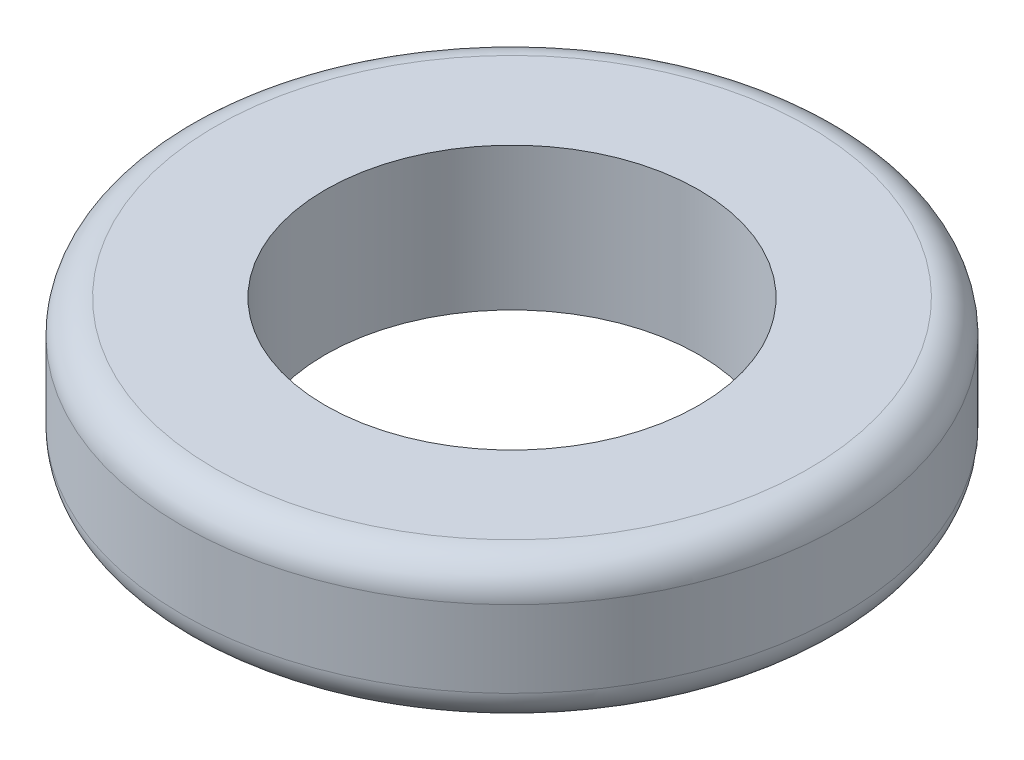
from build123d import *

# Parameters (mm, degrees)
SKETCH1_R           = 7.62
SKETCH1_R_2         = 4.318
BOSS_EXTRUDE1_DEPTH = 3.3
FILLET1_R           = 0.762


with BuildPart() as part:
    # Sketch1 → Boss-Extrude1 (new body)
    with BuildSketch(Plane(origin=(0, 0, 0), x_dir=(1, 0, 0), z_dir=(0, 1, 0))):
        with Locations(Location((0, 0, 0), (0, 0, 270))):
            Circle(SKETCH1_R)
        with Locations(Location((0, 0, 0), (0, 0, 270))):
            Circle(SKETCH1_R_2, mode=Mode.SUBTRACT)
    extrude(amount=BOSS_EXTRUDE1_DEPTH)

    # Fillet1
    fillet1_edges = [part.edges().sort_by_distance(p)[0] for p in [
        (0, 0, -7.62),
        (0, 3.3, -7.62),
    ]]
    fillet(fillet1_edges, radius=FILLET1_R)


solid = part.part
